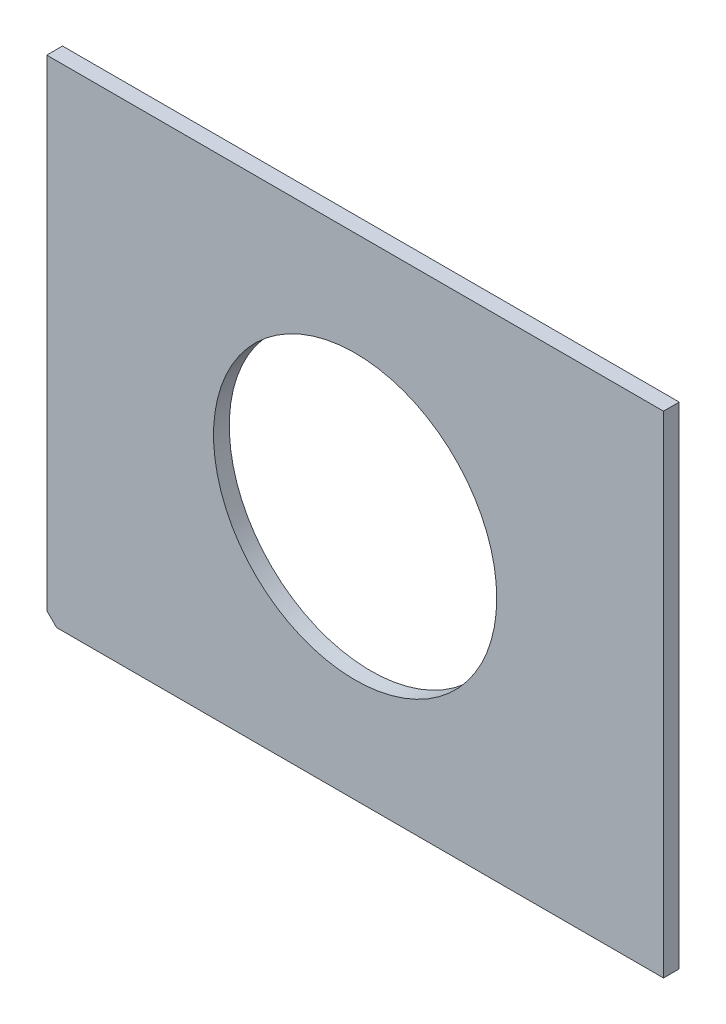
from build123d import *

# Parameters (mm, degrees)
SKETCH1_W           = 196
SKETCH1_H           = 156
SKETCH1_R           = 45
BOSS_EXTRUDE1_DEPTH = 5
CHAMFER1_SIZE       = 3.12


with BuildPart() as part:
    # Sketch1 → Boss-Extrude1 (new body)
    with BuildSketch(Plane.XY):
        Rectangle(SKETCH1_W, SKETCH1_H)
        Circle(SKETCH1_R, mode=Mode.SUBTRACT)
    extrude(amount=-BOSS_EXTRUDE1_DEPTH)

    # Chamfer1
    chamfer1_edges = [part.edges().sort_by_distance(p)[0] for p in [
        (-98, -78, -2.5),
    ]]
    chamfer(chamfer1_edges, length=CHAMFER1_SIZE)


solid = part.part
